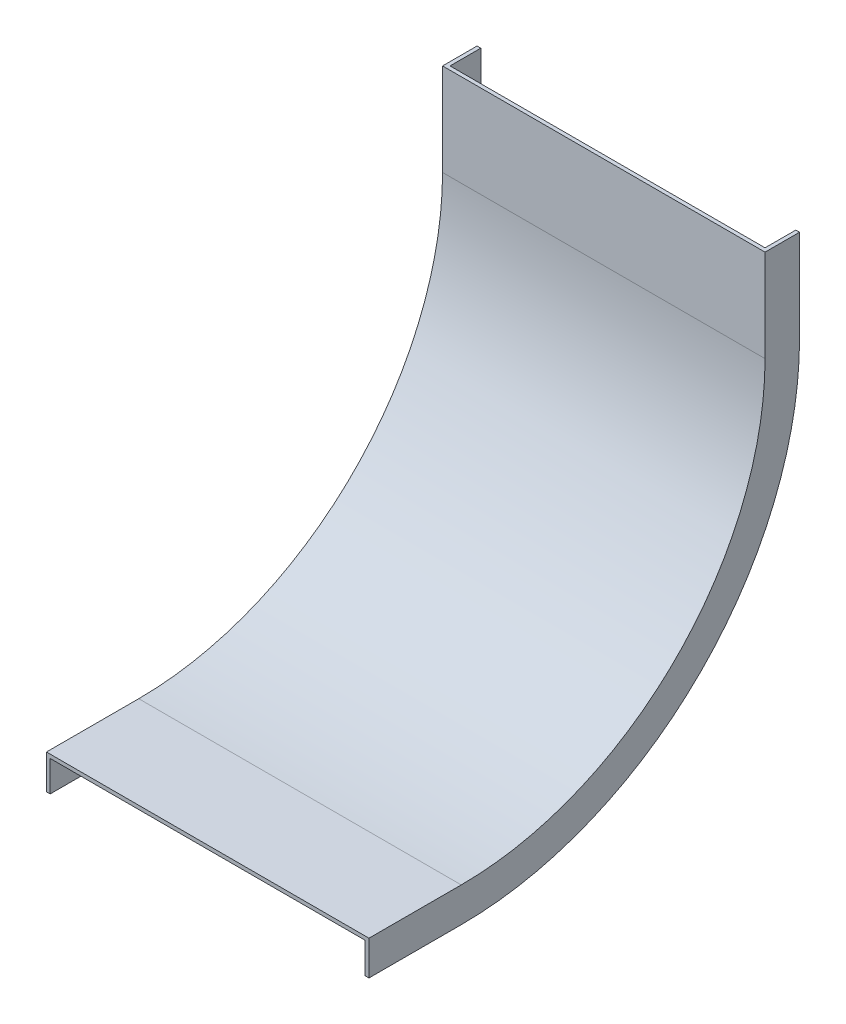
ISO-10303-21;
HEADER;
FILE_DESCRIPTION(('STEP AP214'),'2;1');
FILE_NAME('part.step','',(''),(''),'','','');
FILE_SCHEMA(('AUTOMOTIVE_DESIGN { 1 0 10303 214 1 1 1 1 }'));
ENDSEC;
DATA;
#1=APPLICATION_CONTEXT('core data for automotive mechanical design processes');
#2=APPLICATION_PROTOCOL_DEFINITION('international standard','automotive_design',2000,#1);
#3=PRODUCT_CONTEXT('',#1,'mechanical');
#4=PRODUCT('Part','Part','',(#3));
#5=PRODUCT_RELATED_PRODUCT_CATEGORY('part','',(#4));
#6=PRODUCT_DEFINITION_FORMATION('','',#4);
#7=PRODUCT_DEFINITION_CONTEXT('part definition',#1,'design');
#8=PRODUCT_DEFINITION('design','',#6,#7);
#9=PRODUCT_DEFINITION_SHAPE('','',#8);
#10=(LENGTH_UNIT() NAMED_UNIT(*) SI_UNIT(.MILLI.,.METRE.));
#11=(NAMED_UNIT(*) PLANE_ANGLE_UNIT() SI_UNIT($,.RADIAN.));
#12=(NAMED_UNIT(*) SI_UNIT($,.STERADIAN.) SOLID_ANGLE_UNIT());
#13=UNCERTAINTY_MEASURE_WITH_UNIT(LENGTH_MEASURE(1.E-05),#10,'distance_accuracy_value','');
#14=(GEOMETRIC_REPRESENTATION_CONTEXT(3) GLOBAL_UNCERTAINTY_ASSIGNED_CONTEXT((#13)) GLOBAL_UNIT_ASSIGNED_CONTEXT((#10,
#11,#12)) REPRESENTATION_CONTEXT('',''));
#15=CARTESIAN_POINT('',(0.,0.,0.));
#16=DIRECTION('',(0.,0.,1.));
#17=DIRECTION('',(1.,0.,0.));
#18=AXIS2_PLACEMENT_3D('',#15,#16,#17);
#19=CARTESIAN_POINT('',(-102.428,100.,-140.));
#20=DIRECTION('',(0.,0.,1.));
#21=DIRECTION('',(1.,0.,0.));
#22=AXIS2_PLACEMENT_3D('',#19,#20,#21);
#23=PLANE('',#22);
#24=DIRECTION('',(1.,0.,0.));
#25=VECTOR('',#24,1.);
#26=CARTESIAN_POINT('',(-102.428,100.,-140.));
#27=LINE('',#26,#25);
#28=CARTESIAN_POINT('',(-103.642,100.,-140.));
#29=VERTEX_POINT('',#28);
#30=CARTESIAN_POINT('',(-102.428,100.,-140.));
#31=VERTEX_POINT('',#30);
#32=EDGE_CURVE('E157',#29,#31,#27,.T.);
#33=ORIENTED_EDGE('',*,*,#32,.F.);
#34=DIRECTION('',(0.,1.,0.));
#35=VECTOR('',#34,1.);
#36=CARTESIAN_POINT('',(-103.642,100.,-140.));
#37=LINE('',#36,#35);
#38=CARTESIAN_POINT('',(-103.642,130.,-140.));
#39=VERTEX_POINT('',#38);
#40=EDGE_CURVE('E271',#29,#39,#37,.T.);
#41=ORIENTED_EDGE('',*,*,#40,.T.);
#42=DIRECTION('',(1.,0.,0.));
#43=VECTOR('',#42,1.);
#44=CARTESIAN_POINT('',(-102.428,130.,-140.));
#45=LINE('',#44,#43);
#46=CARTESIAN_POINT('',(-102.428,130.,-140.));
#47=VERTEX_POINT('',#46);
#48=EDGE_CURVE('E53',#39,#47,#45,.T.);
#49=ORIENTED_EDGE('',*,*,#48,.T.);
#50=DIRECTION('',(0.,1.,0.));
#51=VECTOR('',#50,1.);
#52=CARTESIAN_POINT('',(-102.428,100.,-140.));
#53=LINE('',#52,#51);
#54=EDGE_CURVE('E38',#31,#47,#53,.T.);
#55=ORIENTED_EDGE('',*,*,#54,.F.);
#56=EDGE_LOOP('',(#33,#41,#49,#55));
#57=FACE_BOUND('',#56,.T.);
#58=ADVANCED_FACE('F31',(#57),#23,.F.);
#59=CARTESIAN_POINT('',(1.214,100.,-128.786));
#60=DIRECTION('',(0.,0.,-1.));
#61=DIRECTION('',(-1.,0.,0.));
#62=AXIS2_PLACEMENT_3D('',#59,#60,#61);
#63=PLANE('',#62);
#64=DIRECTION('',(-1.,0.,0.));
#65=VECTOR('',#64,1.);
#66=CARTESIAN_POINT('',(1.214,100.,-128.786));
#67=LINE('',#66,#65);
#68=CARTESIAN_POINT('',(1.214,100.,-128.786));
#69=VERTEX_POINT('',#68);
#70=CARTESIAN_POINT('',(-103.642,100.,-128.786));
#71=VERTEX_POINT('',#70);
#72=EDGE_CURVE('E219',#69,#71,#67,.T.);
#73=ORIENTED_EDGE('',*,*,#72,.F.);
#74=DIRECTION('',(0.,1.,0.));
#75=VECTOR('',#74,1.);
#76=CARTESIAN_POINT('',(1.214,100.,-128.786));
#77=LINE('',#76,#75);
#78=CARTESIAN_POINT('',(1.214,130.,-128.786));
#79=VERTEX_POINT('',#78);
#80=EDGE_CURVE('E265',#69,#79,#77,.T.);
#81=ORIENTED_EDGE('',*,*,#80,.T.);
#82=DIRECTION('',(-1.,0.,0.));
#83=VECTOR('',#82,1.);
#84=CARTESIAN_POINT('',(1.214,130.,-128.786));
#85=LINE('',#84,#83);
#86=CARTESIAN_POINT('',(-103.642,130.,-128.786));
#87=VERTEX_POINT('',#86);
#88=EDGE_CURVE('E251',#79,#87,#85,.T.);
#89=ORIENTED_EDGE('',*,*,#88,.T.);
#90=DIRECTION('',(0.,1.,0.));
#91=VECTOR('',#90,1.);
#92=CARTESIAN_POINT('',(-103.642,100.,-128.786));
#93=LINE('',#92,#91);
#94=EDGE_CURVE('E268',#71,#87,#93,.T.);
#95=ORIENTED_EDGE('',*,*,#94,.F.);
#96=EDGE_LOOP('',(#73,#81,#89,#95));
#97=FACE_BOUND('',#96,.T.);
#98=ADVANCED_FACE('F306',(#97),#63,.F.);
#99=CARTESIAN_POINT('',(0.,100.,-140.));
#100=DIRECTION('',(0.,0.,1.));
#101=DIRECTION('',(1.,0.,0.));
#102=AXIS2_PLACEMENT_3D('',#99,#100,#101);
#103=PLANE('',#102);
#104=DIRECTION('',(1.,0.,0.));
#105=VECTOR('',#104,1.);
#106=CARTESIAN_POINT('',(0.,100.,-140.));
#107=LINE('',#106,#105);
#108=CARTESIAN_POINT('',(0.,100.,-140.));
#109=VERTEX_POINT('',#108);
#110=CARTESIAN_POINT('',(1.214,100.,-140.));
#111=VERTEX_POINT('',#110);
#112=EDGE_CURVE('E216',#109,#111,#107,.T.);
#113=ORIENTED_EDGE('',*,*,#112,.F.);
#114=DIRECTION('',(0.,1.,0.));
#115=VECTOR('',#114,1.);
#116=CARTESIAN_POINT('',(0.,100.,-140.));
#117=LINE('',#116,#115);
#118=CARTESIAN_POINT('',(0.,130.,-140.));
#119=VERTEX_POINT('',#118);
#120=EDGE_CURVE('E259',#109,#119,#117,.T.);
#121=ORIENTED_EDGE('',*,*,#120,.T.);
#122=DIRECTION('',(1.,0.,0.));
#123=VECTOR('',#122,1.);
#124=CARTESIAN_POINT('',(0.,130.,-140.));
#125=LINE('',#124,#123);
#126=CARTESIAN_POINT('',(1.214,130.,-140.));
#127=VERTEX_POINT('',#126);
#128=EDGE_CURVE('E247',#119,#127,#125,.T.);
#129=ORIENTED_EDGE('',*,*,#128,.T.);
#130=DIRECTION('',(0.,1.,0.));
#131=VECTOR('',#130,1.);
#132=CARTESIAN_POINT('',(1.214,100.,-140.));
#133=LINE('',#132,#131);
#134=EDGE_CURVE('E262',#111,#127,#133,.T.);
#135=ORIENTED_EDGE('',*,*,#134,.F.);
#136=EDGE_LOOP('',(#113,#121,#129,#135));
#137=FACE_BOUND('',#136,.T.);
#138=ADVANCED_FACE('F310',(#137),#103,.F.);
#139=CARTESIAN_POINT('',(0.,100.,-130.));
#140=DIRECTION('',(0.,0.,1.));
#141=DIRECTION('',(1.,0.,0.));
#142=AXIS2_PLACEMENT_3D('',#139,#140,#141);
#143=PLANE('',#142);
#144=DIRECTION('',(1.,0.,0.));
#145=VECTOR('',#144,1.);
#146=CARTESIAN_POINT('',(0.,100.,-130.));
#147=LINE('',#146,#145);
#148=CARTESIAN_POINT('',(-102.428,100.,-130.));
#149=VERTEX_POINT('',#148);
#150=CARTESIAN_POINT('',(0.,100.,-130.));
#151=VERTEX_POINT('',#150);
#152=EDGE_CURVE('E153',#149,#151,#147,.T.);
#153=ORIENTED_EDGE('',*,*,#152,.F.);
#154=DIRECTION('',(0.,1.,0.));
#155=VECTOR('',#154,1.);
#156=CARTESIAN_POINT('',(-102.428,100.,-130.));
#157=LINE('',#156,#155);
#158=CARTESIAN_POINT('',(-102.428,130.,-130.));
#159=VERTEX_POINT('',#158);
#160=EDGE_CURVE('E11',#149,#159,#157,.T.);
#161=ORIENTED_EDGE('',*,*,#160,.T.);
#162=DIRECTION('',(1.,0.,0.));
#163=VECTOR('',#162,1.);
#164=CARTESIAN_POINT('',(0.,130.,-130.));
#165=LINE('',#164,#163);
#166=CARTESIAN_POINT('',(0.,130.,-130.));
#167=VERTEX_POINT('',#166);
#168=EDGE_CURVE('E243',#159,#167,#165,.T.);
#169=ORIENTED_EDGE('',*,*,#168,.T.);
#170=DIRECTION('',(0.,1.,0.));
#171=VECTOR('',#170,1.);
#172=CARTESIAN_POINT('',(0.,100.,-130.));
#173=LINE('',#172,#171);
#174=EDGE_CURVE('E257',#151,#167,#173,.T.);
#175=ORIENTED_EDGE('',*,*,#174,.F.);
#176=EDGE_LOOP('',(#153,#161,#169,#175));
#177=FACE_BOUND('',#176,.T.);
#178=ADVANCED_FACE('F291',(#177),#143,.F.);
#179=CARTESIAN_POINT('',(0.,100.,-30.));
#180=DIRECTION('',(1.,0.,0.));
#181=DIRECTION('',(0.,0.,-1.));
#182=AXIS2_PLACEMENT_3D('',#179,#180,#181);
#183=CYLINDRICAL_SURFACE('',#182,110.);
#184=DIRECTION('',(1.,0.,0.));
#185=VECTOR('',#184,1.);
#186=CARTESIAN_POINT('',(-102.428,-9.99999999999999,-30.));
#187=LINE('',#186,#185);
#188=CARTESIAN_POINT('',(-103.642,-9.99999999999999,-30.));
#189=VERTEX_POINT('',#188);
#190=CARTESIAN_POINT('',(-102.428,-9.99999999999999,-30.));
#191=VERTEX_POINT('',#190);
#192=EDGE_CURVE('E168',#189,#191,#187,.T.);
#193=ORIENTED_EDGE('',*,*,#192,.F.);
#194=CARTESIAN_POINT('',(-103.642,100.,-30.));
#195=DIRECTION('',(1.,0.,0.));
#196=DIRECTION('',(0.,0.,-1.));
#197=AXIS2_PLACEMENT_3D('',#194,#195,#196);
#198=CIRCLE('',#197,110.);
#199=EDGE_CURVE('E235',#189,#29,#198,.T.);
#200=ORIENTED_EDGE('',*,*,#199,.T.);
#201=ORIENTED_EDGE('',*,*,#32,.T.);
#202=CARTESIAN_POINT('',(-102.428,100.,-30.));
#203=DIRECTION('',(1.,0.,0.));
#204=DIRECTION('',(0.,0.,-1.));
#205=AXIS2_PLACEMENT_3D('',#202,#203,#204);
#206=CIRCLE('',#205,110.);
#207=EDGE_CURVE('E238',#191,#31,#206,.T.);
#208=ORIENTED_EDGE('',*,*,#207,.F.);
#209=EDGE_LOOP('',(#193,#200,#201,#208));
#210=FACE_BOUND('',#209,.T.);
#211=ADVANCED_FACE('F278',(#210),#183,.T.);
#212=CARTESIAN_POINT('',(0.,100.,-30.));
#213=DIRECTION('',(1.,0.,0.));
#214=DIRECTION('',(0.,0.,-1.));
#215=AXIS2_PLACEMENT_3D('',#212,#213,#214);
#216=CYLINDRICAL_SURFACE('',#215,98.786);
#217=DIRECTION('',(-1.,0.,0.));
#218=VECTOR('',#217,1.);
#219=CARTESIAN_POINT('',(1.214,1.214,-30.));
#220=LINE('',#219,#218);
#221=CARTESIAN_POINT('',(1.214,1.214,-30.));
#222=VERTEX_POINT('',#221);
#223=CARTESIAN_POINT('',(-103.642,1.21399999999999,-30.));
#224=VERTEX_POINT('',#223);
#225=EDGE_CURVE('E176',#222,#224,#220,.T.);
#226=ORIENTED_EDGE('',*,*,#225,.F.);
#227=CARTESIAN_POINT('',(1.214,100.,-30.));
#228=DIRECTION('',(1.,0.,0.));
#229=DIRECTION('',(0.,0.,-1.));
#230=AXIS2_PLACEMENT_3D('',#227,#228,#229);
#231=CIRCLE('',#230,98.786);
#232=EDGE_CURVE('E229',#222,#69,#231,.T.);
#233=ORIENTED_EDGE('',*,*,#232,.T.);
#234=ORIENTED_EDGE('',*,*,#72,.T.);
#235=CARTESIAN_POINT('',(-103.642,100.,-30.));
#236=DIRECTION('',(1.,0.,0.));
#237=DIRECTION('',(0.,0.,-1.));
#238=AXIS2_PLACEMENT_3D('',#235,#236,#237);
#239=CIRCLE('',#238,98.786);
#240=EDGE_CURVE('E232',#224,#71,#239,.T.);
#241=ORIENTED_EDGE('',*,*,#240,.F.);
#242=EDGE_LOOP('',(#226,#233,#234,#241));
#243=FACE_BOUND('',#242,.T.);
#244=ADVANCED_FACE('F323',(#243),#216,.F.);
#245=CARTESIAN_POINT('',(0.,100.,-30.));
#246=DIRECTION('',(1.,0.,0.));
#247=DIRECTION('',(0.,0.,-1.));
#248=AXIS2_PLACEMENT_3D('',#245,#246,#247);
#249=CYLINDRICAL_SURFACE('',#248,110.);
#250=DIRECTION('',(1.,0.,0.));
#251=VECTOR('',#250,1.);
#252=CARTESIAN_POINT('',(0.,-10.,-30.));
#253=LINE('',#252,#251);
#254=CARTESIAN_POINT('',(0.,-10.,-30.));
#255=VERTEX_POINT('',#254);
#256=CARTESIAN_POINT('',(1.214,-10.,-30.));
#257=VERTEX_POINT('',#256);
#258=EDGE_CURVE('E172',#255,#257,#253,.T.);
#259=ORIENTED_EDGE('',*,*,#258,.F.);
#260=CARTESIAN_POINT('',(0.,100.,-30.));
#261=DIRECTION('',(1.,0.,0.));
#262=DIRECTION('',(0.,0.,-1.));
#263=AXIS2_PLACEMENT_3D('',#260,#261,#262);
#264=CIRCLE('',#263,110.);
#265=EDGE_CURVE('E156',#255,#109,#264,.T.);
#266=ORIENTED_EDGE('',*,*,#265,.T.);
#267=ORIENTED_EDGE('',*,*,#112,.T.);
#268=CARTESIAN_POINT('',(1.214,100.,-30.));
#269=DIRECTION('',(1.,0.,0.));
#270=DIRECTION('',(0.,0.,-1.));
#271=AXIS2_PLACEMENT_3D('',#268,#269,#270);
#272=CIRCLE('',#271,110.);
#273=EDGE_CURVE('E226',#257,#111,#272,.T.);
#274=ORIENTED_EDGE('',*,*,#273,.F.);
#275=EDGE_LOOP('',(#259,#266,#267,#274));
#276=FACE_BOUND('',#275,.T.);
#277=ADVANCED_FACE('F326',(#276),#249,.T.);
#278=CARTESIAN_POINT('',(0.,100.,-30.));
#279=DIRECTION('',(1.,0.,0.));
#280=DIRECTION('',(0.,0.,-1.));
#281=AXIS2_PLACEMENT_3D('',#278,#279,#280);
#282=CYLINDRICAL_SURFACE('',#281,100.);
#283=DIRECTION('',(1.,0.,0.));
#284=VECTOR('',#283,1.);
#285=CARTESIAN_POINT('',(0.,0.,-30.));
#286=LINE('',#285,#284);
#287=CARTESIAN_POINT('',(-102.428,0.,-30.));
#288=VERTEX_POINT('',#287);
#289=CARTESIAN_POINT('',(0.,0.,-30.));
#290=VERTEX_POINT('',#289);
#291=EDGE_CURVE('E150',#288,#290,#286,.T.);
#292=ORIENTED_EDGE('',*,*,#291,.F.);
#293=CARTESIAN_POINT('',(-102.428,100.,-30.));
#294=DIRECTION('',(1.,0.,0.));
#295=DIRECTION('',(0.,0.,-1.));
#296=AXIS2_PLACEMENT_3D('',#293,#294,#295);
#297=CIRCLE('',#296,100.);
#298=EDGE_CURVE('E241',#288,#149,#297,.T.);
#299=ORIENTED_EDGE('',*,*,#298,.T.);
#300=ORIENTED_EDGE('',*,*,#152,.T.);
#301=CARTESIAN_POINT('',(0.,100.,-30.));
#302=DIRECTION('',(1.,0.,0.));
#303=DIRECTION('',(0.,0.,-1.));
#304=AXIS2_PLACEMENT_3D('',#301,#302,#303);
#305=CIRCLE('',#304,100.);
#306=EDGE_CURVE('E145',#290,#151,#305,.T.);
#307=ORIENTED_EDGE('',*,*,#306,.F.);
#308=EDGE_LOOP('',(#292,#299,#300,#307));
#309=FACE_BOUND('',#308,.T.);
#310=ADVANCED_FACE('F147',(#309),#282,.T.);
#311=CARTESIAN_POINT('',(0.,0.,-30.));
#312=DIRECTION('',(0.,-1.,0.));
#313=DIRECTION('',(1.,0.,0.));
#314=AXIS2_PLACEMENT_3D('',#311,#312,#313);
#315=PLANE('',#314);
#316=DIRECTION('',(1.,0.,0.));
#317=VECTOR('',#316,1.);
#318=CARTESIAN_POINT('',(0.,0.,0.));
#319=LINE('',#318,#317);
#320=CARTESIAN_POINT('',(-102.428,0.,0.));
#321=VERTEX_POINT('',#320);
#322=CARTESIAN_POINT('',(0.,0.,0.));
#323=VERTEX_POINT('',#322);
#324=EDGE_CURVE('E186',#321,#323,#319,.T.);
#325=ORIENTED_EDGE('',*,*,#324,.F.);
#326=DIRECTION('',(0.,0.,1.));
#327=VECTOR('',#326,1.);
#328=CARTESIAN_POINT('',(-102.428,0.,-30.));
#329=LINE('',#328,#327);
#330=EDGE_CURVE('E171',#288,#321,#329,.T.);
#331=ORIENTED_EDGE('',*,*,#330,.F.);
#332=ORIENTED_EDGE('',*,*,#291,.T.);
#333=DIRECTION('',(0.,0.,1.));
#334=VECTOR('',#333,1.);
#335=CARTESIAN_POINT('',(0.,0.,-30.));
#336=LINE('',#335,#334);
#337=EDGE_CURVE('E160',#290,#323,#336,.T.);
#338=ORIENTED_EDGE('',*,*,#337,.T.);
#339=EDGE_LOOP('',(#325,#331,#332,#338));
#340=FACE_BOUND('',#339,.T.);
#341=ADVANCED_FACE('F170',(#340),#315,.T.);
#342=CARTESIAN_POINT('',(-102.428,0.,-30.));
#343=DIRECTION('',(1.,0.,0.));
#344=DIRECTION('',(0.,0.,-1.));
#345=AXIS2_PLACEMENT_3D('',#342,#343,#344);
#346=PLANE('',#345);
#347=DIRECTION('',(0.,1.,0.));
#348=VECTOR('',#347,1.);
#349=CARTESIAN_POINT('',(-102.428,0.,0.));
#350=LINE('',#349,#348);
#351=CARTESIAN_POINT('',(-102.428,-9.99999999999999,0.));
#352=VERTEX_POINT('',#351);
#353=EDGE_CURVE('E173',#352,#321,#350,.T.);
#354=ORIENTED_EDGE('',*,*,#353,.F.);
#355=DIRECTION('',(0.,0.,1.));
#356=VECTOR('',#355,1.);
#357=CARTESIAN_POINT('',(-102.428,-9.99999999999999,-30.));
#358=LINE('',#357,#356);
#359=EDGE_CURVE('E204',#191,#352,#358,.T.);
#360=ORIENTED_EDGE('',*,*,#359,.F.);
#361=ORIENTED_EDGE('',*,*,#207,.T.);
#362=ORIENTED_EDGE('',*,*,#54,.T.);
#363=DIRECTION('',(0.,0.,1.));
#364=VECTOR('',#363,1.);
#365=CARTESIAN_POINT('',(-102.428,130.,-130.));
#366=LINE('',#365,#364);
#367=EDGE_CURVE('E45',#47,#159,#366,.T.);
#368=ORIENTED_EDGE('',*,*,#367,.T.);
#369=ORIENTED_EDGE('',*,*,#160,.F.);
#370=ORIENTED_EDGE('',*,*,#298,.F.);
#371=ORIENTED_EDGE('',*,*,#330,.T.);
#372=EDGE_LOOP('',(#354,#360,#361,#362,#368,#369,#370,#371));
#373=FACE_BOUND('',#372,.T.);
#374=ADVANCED_FACE('F273',(#373),#346,.T.);
#375=CARTESIAN_POINT('',(-102.428,-9.99999999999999,-30.));
#376=DIRECTION('',(0.,-1.,0.));
#377=DIRECTION('',(0.,0.,-1.));
#378=AXIS2_PLACEMENT_3D('',#375,#376,#377);
#379=PLANE('',#378);
#380=DIRECTION('',(1.,0.,0.));
#381=VECTOR('',#380,1.);
#382=CARTESIAN_POINT('',(-102.428,-9.99999999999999,0.));
#383=LINE('',#382,#381);
#384=CARTESIAN_POINT('',(-103.642,-9.99999999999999,0.));
#385=VERTEX_POINT('',#384);
#386=EDGE_CURVE('E179',#385,#352,#383,.T.);
#387=ORIENTED_EDGE('',*,*,#386,.F.);
#388=DIRECTION('',(0.,0.,1.));
#389=VECTOR('',#388,1.);
#390=CARTESIAN_POINT('',(-103.642,-9.99999999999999,-30.));
#391=LINE('',#390,#389);
#392=EDGE_CURVE('E206',#189,#385,#391,.T.);
#393=ORIENTED_EDGE('',*,*,#392,.F.);
#394=ORIENTED_EDGE('',*,*,#192,.T.);
#395=ORIENTED_EDGE('',*,*,#359,.T.);
#396=EDGE_LOOP('',(#387,#393,#394,#395));
#397=FACE_BOUND('',#396,.T.);
#398=ADVANCED_FACE('F295',(#397),#379,.T.);
#399=CARTESIAN_POINT('',(-103.642,1.21399999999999,-30.));
#400=DIRECTION('',(-1.,0.,0.));
#401=DIRECTION('',(0.,0.,1.));
#402=AXIS2_PLACEMENT_3D('',#399,#400,#401);
#403=PLANE('',#402);
#404=DIRECTION('',(0.,-1.,0.));
#405=VECTOR('',#404,1.);
#406=CARTESIAN_POINT('',(-103.642,1.21399999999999,0.));
#407=LINE('',#406,#405);
#408=CARTESIAN_POINT('',(-103.642,1.21399999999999,0.));
#409=VERTEX_POINT('',#408);
#410=EDGE_CURVE('E198',#409,#385,#407,.T.);
#411=ORIENTED_EDGE('',*,*,#410,.F.);
#412=DIRECTION('',(0.,0.,1.));
#413=VECTOR('',#412,1.);
#414=CARTESIAN_POINT('',(-103.642,1.21399999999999,-30.));
#415=LINE('',#414,#413);
#416=EDGE_CURVE('E208',#224,#409,#415,.T.);
#417=ORIENTED_EDGE('',*,*,#416,.F.);
#418=ORIENTED_EDGE('',*,*,#240,.T.);
#419=ORIENTED_EDGE('',*,*,#94,.T.);
#420=DIRECTION('',(0.,0.,-1.));
#421=VECTOR('',#420,1.);
#422=CARTESIAN_POINT('',(-103.642,130.,-128.786));
#423=LINE('',#422,#421);
#424=EDGE_CURVE('E253',#87,#39,#423,.T.);
#425=ORIENTED_EDGE('',*,*,#424,.T.);
#426=ORIENTED_EDGE('',*,*,#40,.F.);
#427=ORIENTED_EDGE('',*,*,#199,.F.);
#428=ORIENTED_EDGE('',*,*,#392,.T.);
#429=EDGE_LOOP('',(#411,#417,#418,#419,#425,#426,#427,#428));
#430=FACE_BOUND('',#429,.T.);
#431=ADVANCED_FACE('F282',(#430),#403,.T.);
#432=CARTESIAN_POINT('',(1.214,1.214,-30.));
#433=DIRECTION('',(0.,1.,0.));
#434=DIRECTION('',(-1.,0.,0.));
#435=AXIS2_PLACEMENT_3D('',#432,#433,#434);
#436=PLANE('',#435);
#437=DIRECTION('',(-1.,0.,0.));
#438=VECTOR('',#437,1.);
#439=CARTESIAN_POINT('',(1.214,1.214,0.));
#440=LINE('',#439,#438);
#441=CARTESIAN_POINT('',(1.214,1.214,0.));
#442=VERTEX_POINT('',#441);
#443=EDGE_CURVE('E195',#442,#409,#440,.T.);
#444=ORIENTED_EDGE('',*,*,#443,.F.);
#445=DIRECTION('',(0.,0.,1.));
#446=VECTOR('',#445,1.);
#447=CARTESIAN_POINT('',(1.214,1.214,-30.));
#448=LINE('',#447,#446);
#449=EDGE_CURVE('E210',#222,#442,#448,.T.);
#450=ORIENTED_EDGE('',*,*,#449,.F.);
#451=ORIENTED_EDGE('',*,*,#225,.T.);
#452=ORIENTED_EDGE('',*,*,#416,.T.);
#453=EDGE_LOOP('',(#444,#450,#451,#452));
#454=FACE_BOUND('',#453,.T.);
#455=ADVANCED_FACE('F302',(#454),#436,.T.);
#456=CARTESIAN_POINT('',(1.214,-10.,-30.));
#457=DIRECTION('',(1.,0.,0.));
#458=DIRECTION('',(0.,1.,0.));
#459=AXIS2_PLACEMENT_3D('',#456,#457,#458);
#460=PLANE('',#459);
#461=DIRECTION('',(0.,1.,0.));
#462=VECTOR('',#461,1.);
#463=CARTESIAN_POINT('',(1.214,-10.,0.));
#464=LINE('',#463,#462);
#465=CARTESIAN_POINT('',(1.214,-10.,0.));
#466=VERTEX_POINT('',#465);
#467=EDGE_CURVE('E192',#466,#442,#464,.T.);
#468=ORIENTED_EDGE('',*,*,#467,.F.);
#469=DIRECTION('',(0.,0.,1.));
#470=VECTOR('',#469,1.);
#471=CARTESIAN_POINT('',(1.214,-10.,-30.));
#472=LINE('',#471,#470);
#473=EDGE_CURVE('E212',#257,#466,#472,.T.);
#474=ORIENTED_EDGE('',*,*,#473,.F.);
#475=ORIENTED_EDGE('',*,*,#273,.T.);
#476=ORIENTED_EDGE('',*,*,#134,.T.);
#477=DIRECTION('',(0.,0.,1.));
#478=VECTOR('',#477,1.);
#479=CARTESIAN_POINT('',(1.214,130.,-140.));
#480=LINE('',#479,#478);
#481=EDGE_CURVE('E249',#127,#79,#480,.T.);
#482=ORIENTED_EDGE('',*,*,#481,.T.);
#483=ORIENTED_EDGE('',*,*,#80,.F.);
#484=ORIENTED_EDGE('',*,*,#232,.F.);
#485=ORIENTED_EDGE('',*,*,#449,.T.);
#486=EDGE_LOOP('',(#468,#474,#475,#476,#482,#483,#484,#485));
#487=FACE_BOUND('',#486,.T.);
#488=ADVANCED_FACE('F340',(#487),#460,.T.);
#489=CARTESIAN_POINT('',(0.,-10.,-30.));
#490=DIRECTION('',(0.,-1.,0.));
#491=DIRECTION('',(0.,0.,-1.));
#492=AXIS2_PLACEMENT_3D('',#489,#490,#491);
#493=PLANE('',#492);
#494=DIRECTION('',(1.,0.,0.));
#495=VECTOR('',#494,1.);
#496=CARTESIAN_POINT('',(0.,-10.,0.));
#497=LINE('',#496,#495);
#498=CARTESIAN_POINT('',(0.,-10.,0.));
#499=VERTEX_POINT('',#498);
#500=EDGE_CURVE('E189',#499,#466,#497,.T.);
#501=ORIENTED_EDGE('',*,*,#500,.F.);
#502=DIRECTION('',(0.,0.,1.));
#503=VECTOR('',#502,1.);
#504=CARTESIAN_POINT('',(0.,-10.,-30.));
#505=LINE('',#504,#503);
#506=EDGE_CURVE('E167',#255,#499,#505,.T.);
#507=ORIENTED_EDGE('',*,*,#506,.F.);
#508=ORIENTED_EDGE('',*,*,#258,.T.);
#509=ORIENTED_EDGE('',*,*,#473,.T.);
#510=EDGE_LOOP('',(#501,#507,#508,#509));
#511=FACE_BOUND('',#510,.T.);
#512=ADVANCED_FACE('F337',(#511),#493,.T.);
#513=CARTESIAN_POINT('',(0.,-10.,-30.));
#514=DIRECTION('',(-1.,0.,0.));
#515=DIRECTION('',(0.,0.,1.));
#516=AXIS2_PLACEMENT_3D('',#513,#514,#515);
#517=PLANE('',#516);
#518=DIRECTION('',(0.,-1.,0.));
#519=VECTOR('',#518,1.);
#520=CARTESIAN_POINT('',(0.,-10.,0.));
#521=LINE('',#520,#519);
#522=EDGE_CURVE('E163',#323,#499,#521,.T.);
#523=ORIENTED_EDGE('',*,*,#522,.F.);
#524=ORIENTED_EDGE('',*,*,#337,.F.);
#525=ORIENTED_EDGE('',*,*,#306,.T.);
#526=ORIENTED_EDGE('',*,*,#174,.T.);
#527=DIRECTION('',(0.,0.,-1.));
#528=VECTOR('',#527,1.);
#529=CARTESIAN_POINT('',(0.,130.,-140.));
#530=LINE('',#529,#528);
#531=EDGE_CURVE('E245',#167,#119,#530,.T.);
#532=ORIENTED_EDGE('',*,*,#531,.T.);
#533=ORIENTED_EDGE('',*,*,#120,.F.);
#534=ORIENTED_EDGE('',*,*,#265,.F.);
#535=ORIENTED_EDGE('',*,*,#506,.T.);
#536=EDGE_LOOP('',(#523,#524,#525,#526,#532,#533,#534,#535));
#537=FACE_BOUND('',#536,.T.);
#538=ADVANCED_FACE('F161',(#537),#517,.T.);
#539=CARTESIAN_POINT('',(-102.428,130.,-130.));
#540=DIRECTION('',(0.,-1.,0.));
#541=DIRECTION('',(1.,0.,0.));
#542=AXIS2_PLACEMENT_3D('',#539,#540,#541);
#543=PLANE('',#542);
#544=ORIENTED_EDGE('',*,*,#168,.F.);
#545=ORIENTED_EDGE('',*,*,#367,.F.);
#546=ORIENTED_EDGE('',*,*,#48,.F.);
#547=ORIENTED_EDGE('',*,*,#424,.F.);
#548=ORIENTED_EDGE('',*,*,#88,.F.);
#549=ORIENTED_EDGE('',*,*,#481,.F.);
#550=ORIENTED_EDGE('',*,*,#128,.F.);
#551=ORIENTED_EDGE('',*,*,#531,.F.);
#552=EDGE_LOOP('',(#544,#545,#546,#547,#548,#549,#550,#551));
#553=FACE_BOUND('',#552,.T.);
#554=ADVANCED_FACE('F287',(#553),#543,.F.);
#555=CARTESIAN_POINT('',(-102.428,0.,0.));
#556=DIRECTION('',(0.,0.,1.));
#557=DIRECTION('',(1.,0.,0.));
#558=AXIS2_PLACEMENT_3D('',#555,#556,#557);
#559=PLANE('',#558);
#560=ORIENTED_EDGE('',*,*,#324,.T.);
#561=ORIENTED_EDGE('',*,*,#522,.T.);
#562=ORIENTED_EDGE('',*,*,#500,.T.);
#563=ORIENTED_EDGE('',*,*,#467,.T.);
#564=ORIENTED_EDGE('',*,*,#443,.T.);
#565=ORIENTED_EDGE('',*,*,#410,.T.);
#566=ORIENTED_EDGE('',*,*,#386,.T.);
#567=ORIENTED_EDGE('',*,*,#353,.T.);
#568=EDGE_LOOP('',(#560,#561,#562,#563,#564,#565,#566,#567));
#569=FACE_BOUND('',#568,.T.);
#570=ADVANCED_FACE('F293',(#569),#559,.T.);
#571=CLOSED_SHELL('',(#58,#98,#138,#178,#211,#244,#277,#310,#341,#374,#398,#431,#455,#488,#512,
#538,#554,#570));
#572=MANIFOLD_SOLID_BREP('B2',#571);
#573=ADVANCED_BREP_SHAPE_REPRESENTATION('',(#18,#572),#14);
#574=SHAPE_DEFINITION_REPRESENTATION(#9,#573);
ENDSEC;
END-ISO-10303-21;
